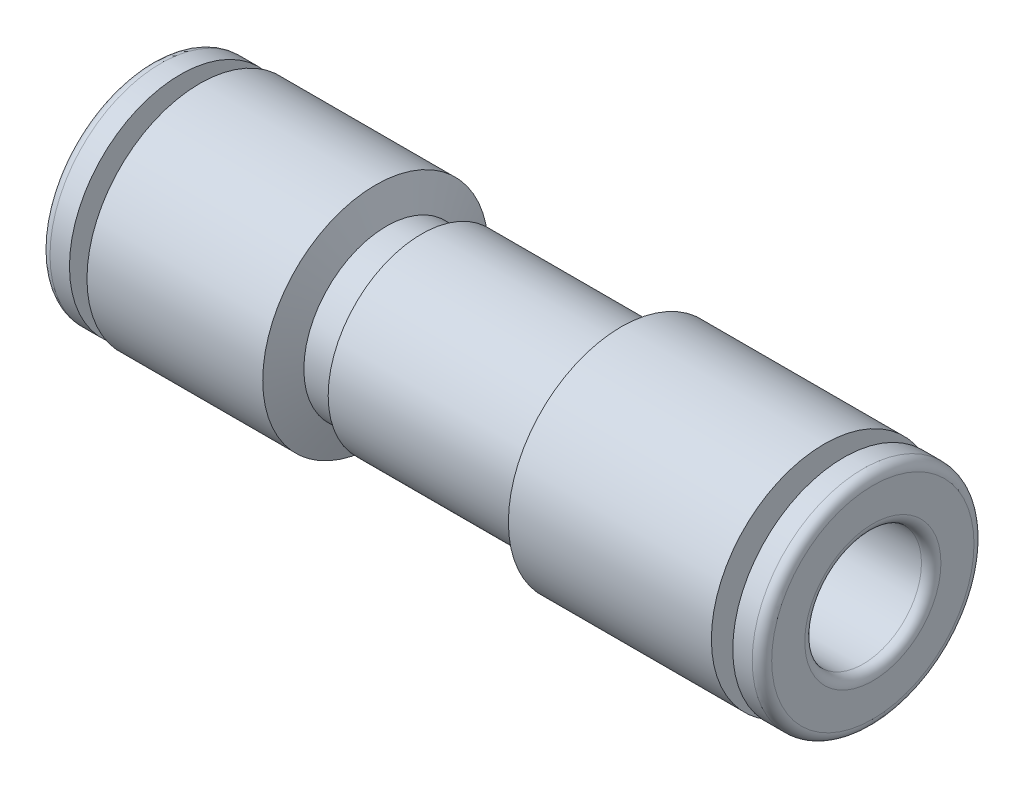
ISO-10303-21;
HEADER;
FILE_DESCRIPTION(('STEP AP214'),'2;1');
FILE_NAME('part.step','',(''),(''),'','','');
FILE_SCHEMA(('AUTOMOTIVE_DESIGN { 1 0 10303 214 1 1 1 1 }'));
ENDSEC;
DATA;
#1=APPLICATION_CONTEXT('core data for automotive mechanical design processes');
#2=APPLICATION_PROTOCOL_DEFINITION('international standard','automotive_design',2000,#1);
#3=PRODUCT_CONTEXT('',#1,'mechanical');
#4=PRODUCT('Part','Part','',(#3));
#5=PRODUCT_RELATED_PRODUCT_CATEGORY('part','',(#4));
#6=PRODUCT_DEFINITION_FORMATION('','',#4);
#7=PRODUCT_DEFINITION_CONTEXT('part definition',#1,'design');
#8=PRODUCT_DEFINITION('design','',#6,#7);
#9=PRODUCT_DEFINITION_SHAPE('','',#8);
#10=(LENGTH_UNIT() NAMED_UNIT(*) SI_UNIT(.MILLI.,.METRE.));
#11=(NAMED_UNIT(*) PLANE_ANGLE_UNIT() SI_UNIT($,.RADIAN.));
#12=(NAMED_UNIT(*) SI_UNIT($,.STERADIAN.) SOLID_ANGLE_UNIT());
#13=UNCERTAINTY_MEASURE_WITH_UNIT(LENGTH_MEASURE(1.E-05),#10,'distance_accuracy_value','');
#14=(GEOMETRIC_REPRESENTATION_CONTEXT(3) GLOBAL_UNCERTAINTY_ASSIGNED_CONTEXT((#13)) GLOBAL_UNIT_ASSIGNED_CONTEXT((#10,
#11,#12)) REPRESENTATION_CONTEXT('',''));
#15=CARTESIAN_POINT('',(0.,0.,0.));
#16=DIRECTION('',(0.,0.,1.));
#17=DIRECTION('',(1.,0.,0.));
#18=AXIS2_PLACEMENT_3D('',#15,#16,#17);
#19=CARTESIAN_POINT('',(0.123549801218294,0.,0.));
#20=DIRECTION('',(1.,0.,0.));
#21=DIRECTION('',(0.,0.,-1.));
#22=AXIS2_PLACEMENT_3D('',#19,#20,#21);
#23=CYLINDRICAL_SURFACE('',#22,4.8);
#24=CARTESIAN_POINT('',(13.9001836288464,0.,0.));
#25=DIRECTION('',(1.,0.,0.));
#26=DIRECTION('',(0.,0.,-1.));
#27=AXIS2_PLACEMENT_3D('',#24,#25,#26);
#28=CIRCLE('',#27,4.8);
#29=CARTESIAN_POINT('',(13.9001836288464,0.,-4.8));
#30=VERTEX_POINT('',#29);
#31=EDGE_CURVE('E50',#30,#30,#28,.T.);
#32=ORIENTED_EDGE('',*,*,#31,.T.);
#33=EDGE_LOOP('',(#32));
#34=FACE_BOUND('',#33,.T.);
#35=CARTESIAN_POINT('',(23.8,0.,0.));
#36=DIRECTION('',(1.,0.,0.));
#37=DIRECTION('',(0.,0.,-1.));
#38=AXIS2_PLACEMENT_3D('',#35,#36,#37);
#39=CIRCLE('',#38,4.8);
#40=CARTESIAN_POINT('',(23.8,0.,-4.79999999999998));
#41=VERTEX_POINT('',#40);
#42=EDGE_CURVE('E57',#41,#41,#39,.F.);
#43=ORIENTED_EDGE('',*,*,#42,.T.);
#44=EDGE_LOOP('',(#43));
#45=FACE_BOUND('',#44,.T.);
#46=ADVANCED_FACE('F33',(#34,#45),#23,.T.);
#47=CARTESIAN_POINT('',(46.6208152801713,0.,0.));
#48=DIRECTION('',(-1.,0.,0.));
#49=DIRECTION('',(0.,0.,1.));
#50=AXIS2_PLACEMENT_3D('',#47,#48,#49);
#51=CYLINDRICAL_SURFACE('',#50,4.25);
#52=CARTESIAN_POINT('',(12.1,0.,0.));
#53=DIRECTION('',(1.,0.,0.));
#54=DIRECTION('',(0.,0.,-1.));
#55=AXIS2_PLACEMENT_3D('',#52,#53,#54);
#56=CIRCLE('',#55,4.25);
#57=CARTESIAN_POINT('',(12.1,0.,-4.25));
#58=VERTEX_POINT('',#57);
#59=EDGE_CURVE('E65',#58,#58,#56,.T.);
#60=ORIENTED_EDGE('',*,*,#59,.T.);
#61=EDGE_LOOP('',(#60));
#62=FACE_BOUND('',#61,.T.);
#63=CARTESIAN_POINT('',(13.7,0.,0.));
#64=DIRECTION('',(1.,0.,0.));
#65=DIRECTION('',(0.,0.,-1.));
#66=AXIS2_PLACEMENT_3D('',#63,#64,#65);
#67=CIRCLE('',#66,4.25);
#68=CARTESIAN_POINT('',(13.7,0.,-4.25));
#69=VERTEX_POINT('',#68);
#70=EDGE_CURVE('E56',#69,#69,#67,.T.);
#71=ORIENTED_EDGE('',*,*,#70,.F.);
#72=EDGE_LOOP('',(#71));
#73=FACE_BOUND('',#72,.T.);
#74=ADVANCED_FACE('F140',(#62,#73),#51,.T.);
#75=CARTESIAN_POINT('',(0.,0.,0.));
#76=DIRECTION('',(-1.,0.,0.));
#77=DIRECTION('',(0.,0.,1.));
#78=AXIS2_PLACEMENT_3D('',#75,#76,#77);
#79=CYLINDRICAL_SURFACE('',#78,3.75);
#80=CARTESIAN_POINT('',(1.5,0.,0.));
#81=DIRECTION('',(-1.,0.,0.));
#82=DIRECTION('',(0.,0.,1.));
#83=AXIS2_PLACEMENT_3D('',#80,#81,#82);
#84=CIRCLE('',#83,3.75);
#85=CARTESIAN_POINT('',(1.5,0.,3.75));
#86=VERTEX_POINT('',#85);
#87=EDGE_CURVE('E64',#86,#86,#84,.T.);
#88=ORIENTED_EDGE('',*,*,#87,.F.);
#89=EDGE_LOOP('',(#88));
#90=FACE_BOUND('',#89,.T.);
#91=CARTESIAN_POINT('',(2.5,0.,0.));
#92=DIRECTION('',(1.,0.,0.));
#93=DIRECTION('',(0.,0.,-1.));
#94=AXIS2_PLACEMENT_3D('',#91,#92,#93);
#95=CIRCLE('',#94,3.75);
#96=CARTESIAN_POINT('',(2.5,0.,-3.75));
#97=VERTEX_POINT('',#96);
#98=EDGE_CURVE('E68',#97,#97,#95,.T.);
#99=ORIENTED_EDGE('',*,*,#98,.F.);
#100=EDGE_LOOP('',(#99));
#101=FACE_BOUND('',#100,.T.);
#102=ADVANCED_FACE('F146',(#90,#101),#79,.T.);
#103=CARTESIAN_POINT('',(1.5,5.7,0.));
#104=DIRECTION('',(-1.,0.,0.));
#105=DIRECTION('',(0.,0.,1.));
#106=AXIS2_PLACEMENT_3D('',#103,#104,#105);
#107=PLANE('',#106);
#108=CARTESIAN_POINT('',(1.5,0.,0.));
#109=DIRECTION('',(-1.,0.,0.));
#110=DIRECTION('',(0.,0.,1.));
#111=AXIS2_PLACEMENT_3D('',#108,#109,#110);
#112=CIRCLE('',#111,5.7);
#113=CARTESIAN_POINT('',(1.5,0.,5.7));
#114=VERTEX_POINT('',#113);
#115=EDGE_CURVE('E71',#114,#114,#112,.T.);
#116=ORIENTED_EDGE('',*,*,#115,.F.);
#117=EDGE_LOOP('',(#116));
#118=FACE_BOUND('',#117,.T.);
#119=ORIENTED_EDGE('',*,*,#87,.T.);
#120=EDGE_LOOP('',(#119));
#121=FACE_BOUND('',#120,.T.);
#122=ADVANCED_FACE('F178',(#118,#121),#107,.F.);
#123=CARTESIAN_POINT('',(0.,0.,0.));
#124=DIRECTION('',(-1.,0.,0.));
#125=DIRECTION('',(0.,0.,1.));
#126=AXIS2_PLACEMENT_3D('',#123,#124,#125);
#127=CYLINDRICAL_SURFACE('',#126,5.7);
#128=CARTESIAN_POINT('',(0.5,0.,0.));
#129=DIRECTION('',(-1.,0.,0.));
#130=DIRECTION('',(0.,0.,1.));
#131=AXIS2_PLACEMENT_3D('',#128,#129,#130);
#132=CIRCLE('',#131,5.7);
#133=CARTESIAN_POINT('',(0.5,0.,5.7));
#134=VERTEX_POINT('',#133);
#135=EDGE_CURVE('E74',#134,#134,#132,.T.);
#136=ORIENTED_EDGE('',*,*,#135,.F.);
#137=EDGE_LOOP('',(#136));
#138=FACE_BOUND('',#137,.T.);
#139=ORIENTED_EDGE('',*,*,#115,.T.);
#140=EDGE_LOOP('',(#139));
#141=FACE_BOUND('',#140,.T.);
#142=ADVANCED_FACE('F174',(#138,#141),#127,.T.);
#143=CARTESIAN_POINT('',(0.5,0.,0.));
#144=DIRECTION('',(-1.,0.,0.));
#145=DIRECTION('',(0.,0.,1.));
#146=AXIS2_PLACEMENT_3D('',#143,#144,#145);
#147=TOROIDAL_SURFACE('',#146,5.2,0.5);
#148=CARTESIAN_POINT('',(0.,0.,0.));
#149=DIRECTION('',(-1.,0.,0.));
#150=DIRECTION('',(0.,0.,1.));
#151=AXIS2_PLACEMENT_3D('',#148,#149,#150);
#152=CIRCLE('',#151,5.2);
#153=CARTESIAN_POINT('',(0.,0.,5.2));
#154=VERTEX_POINT('',#153);
#155=EDGE_CURVE('E77',#154,#154,#152,.T.);
#156=ORIENTED_EDGE('',*,*,#155,.F.);
#157=EDGE_LOOP('',(#156));
#158=FACE_BOUND('',#157,.T.);
#159=ORIENTED_EDGE('',*,*,#135,.T.);
#160=EDGE_LOOP('',(#159));
#161=FACE_BOUND('',#160,.T.);
#162=ADVANCED_FACE('F170',(#158,#161),#147,.T.);
#163=CARTESIAN_POINT('',(0.,0.,0.));
#164=DIRECTION('',(1.,0.,0.));
#165=DIRECTION('',(0.,0.,-1.));
#166=AXIS2_PLACEMENT_3D('',#163,#164,#165);
#167=PLANE('',#166);
#168=CARTESIAN_POINT('',(0.,0.,0.));
#169=DIRECTION('',(1.,0.,0.));
#170=DIRECTION('',(0.,0.,-1.));
#171=AXIS2_PLACEMENT_3D('',#168,#169,#170);
#172=CIRCLE('',#171,3.5);
#173=CARTESIAN_POINT('',(0.,0.,-3.5));
#174=VERTEX_POINT('',#173);
#175=EDGE_CURVE('E41',#174,#174,#172,.T.);
#176=ORIENTED_EDGE('',*,*,#175,.T.);
#177=EDGE_LOOP('',(#176));
#178=FACE_BOUND('',#177,.T.);
#179=ORIENTED_EDGE('',*,*,#155,.T.);
#180=EDGE_LOOP('',(#179));
#181=FACE_BOUND('',#180,.T.);
#182=ADVANCED_FACE('F160',(#178,#181),#167,.F.);
#183=CARTESIAN_POINT('',(2.5,0.,0.));
#184=DIRECTION('',(1.,0.,0.));
#185=DIRECTION('',(0.,0.,-1.));
#186=AXIS2_PLACEMENT_3D('',#183,#184,#185);
#187=PLANE('',#186);
#188=ORIENTED_EDGE('',*,*,#98,.T.);
#189=EDGE_LOOP('',(#188));
#190=FACE_BOUND('',#189,.T.);
#191=CARTESIAN_POINT('',(2.5,0.,0.));
#192=DIRECTION('',(1.,0.,0.));
#193=DIRECTION('',(0.,0.,-1.));
#194=AXIS2_PLACEMENT_3D('',#191,#192,#193);
#195=CIRCLE('',#194,5.8);
#196=CARTESIAN_POINT('',(2.5,0.,5.8));
#197=VERTEX_POINT('',#196);
#198=EDGE_CURVE('E60',#197,#197,#195,.T.);
#199=ORIENTED_EDGE('',*,*,#198,.F.);
#200=EDGE_LOOP('',(#199));
#201=FACE_BOUND('',#200,.T.);
#202=ADVANCED_FACE('F157',(#190,#201),#187,.F.);
#203=CARTESIAN_POINT('',(28.5048773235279,0.,0.));
#204=DIRECTION('',(-1.,0.,0.));
#205=DIRECTION('',(0.,0.,1.));
#206=AXIS2_PLACEMENT_3D('',#203,#204,#205);
#207=CYLINDRICAL_SURFACE('',#206,5.8);
#208=CARTESIAN_POINT('',(11.5358461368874,0.,0.));
#209=DIRECTION('',(1.,0.,0.));
#210=DIRECTION('',(0.,0.,-1.));
#211=AXIS2_PLACEMENT_3D('',#208,#209,#210);
#212=CIRCLE('',#211,5.8);
#213=CARTESIAN_POINT('',(11.5358461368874,0.,5.8));
#214=VERTEX_POINT('',#213);
#215=EDGE_CURVE('E53',#214,#214,#212,.F.);
#216=CARTESIAN_POINT('',(11.5358461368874,0.,5.8));
#217=CARTESIAN_POINT('',(11.4417227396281,0.,5.8));
#218=CARTESIAN_POINT('',(11.3475993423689,0.,5.8));
#219=CARTESIAN_POINT('',(11.1593525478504,0.,5.8));
#220=CARTESIAN_POINT('',(11.0652291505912,0.,5.8));
#221=CARTESIAN_POINT('',(10.8769823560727,0.,5.8));
#222=CARTESIAN_POINT('',(10.7828589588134,0.,5.8));
#223=CARTESIAN_POINT('',(10.594612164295,0.,5.8));
#224=CARTESIAN_POINT('',(10.5004887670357,0.,5.8));
#225=CARTESIAN_POINT('',(10.3122419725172,0.,5.8));
#226=CARTESIAN_POINT('',(10.218118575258,0.,5.8));
#227=CARTESIAN_POINT('',(10.0298717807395,0.,5.8));
#228=CARTESIAN_POINT('',(9.93574838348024,0.,5.8));
#229=CARTESIAN_POINT('',(9.74750158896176,0.,5.8));
#230=CARTESIAN_POINT('',(9.65337819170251,0.,5.8));
#231=CARTESIAN_POINT('',(9.46513139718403,0.,5.8));
#232=CARTESIAN_POINT('',(9.37100799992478,0.,5.8));
#233=CARTESIAN_POINT('',(9.1827612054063,0.,5.8));
#234=CARTESIAN_POINT('',(9.08863780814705,0.,5.8));
#235=CARTESIAN_POINT('',(8.90039101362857,0.,5.8));
#236=CARTESIAN_POINT('',(8.80626761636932,0.,5.8));
#237=CARTESIAN_POINT('',(8.61802082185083,0.,5.8));
#238=CARTESIAN_POINT('',(8.52389742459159,0.,5.8));
#239=CARTESIAN_POINT('',(8.3356506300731,0.,5.8));
#240=CARTESIAN_POINT('',(8.24152723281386,0.,5.8));
#241=CARTESIAN_POINT('',(8.05328043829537,0.,5.8));
#242=CARTESIAN_POINT('',(7.95915704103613,0.,5.8));
#243=CARTESIAN_POINT('',(7.77091024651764,0.,5.8));
#244=CARTESIAN_POINT('',(7.6767868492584,0.,5.8));
#245=CARTESIAN_POINT('',(7.48854005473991,0.,5.8));
#246=CARTESIAN_POINT('',(7.39441665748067,0.,5.8));
#247=CARTESIAN_POINT('',(7.20616986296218,0.,5.8));
#248=CARTESIAN_POINT('',(7.11204646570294,0.,5.8));
#249=CARTESIAN_POINT('',(6.92379967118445,0.,5.8));
#250=CARTESIAN_POINT('',(6.82967627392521,0.,5.8));
#251=CARTESIAN_POINT('',(6.64142947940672,0.,5.8));
#252=CARTESIAN_POINT('',(6.54730608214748,0.,5.8));
#253=CARTESIAN_POINT('',(6.35905928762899,0.,5.8));
#254=CARTESIAN_POINT('',(6.26493589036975,0.,5.8));
#255=CARTESIAN_POINT('',(6.07668909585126,0.,5.8));
#256=CARTESIAN_POINT('',(5.98256569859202,0.,5.8));
#257=CARTESIAN_POINT('',(5.79431890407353,0.,5.8));
#258=CARTESIAN_POINT('',(5.70019550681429,0.,5.8));
#259=CARTESIAN_POINT('',(5.5119487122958,0.,5.8));
#260=CARTESIAN_POINT('',(5.41782531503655,0.,5.8));
#261=CARTESIAN_POINT('',(5.22957852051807,0.,5.8));
#262=CARTESIAN_POINT('',(5.13545512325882,0.,5.8));
#263=CARTESIAN_POINT('',(4.94720832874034,0.,5.8));
#264=CARTESIAN_POINT('',(4.85308493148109,0.,5.8));
#265=CARTESIAN_POINT('',(4.6648381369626,0.,5.8));
#266=CARTESIAN_POINT('',(4.57071473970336,0.,5.8));
#267=CARTESIAN_POINT('',(4.38246794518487,0.,5.8));
#268=CARTESIAN_POINT('',(4.28834454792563,0.,5.8));
#269=CARTESIAN_POINT('',(4.10009775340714,0.,5.8));
#270=CARTESIAN_POINT('',(4.0059743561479,0.,5.8));
#271=CARTESIAN_POINT('',(3.81772756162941,0.,5.8));
#272=CARTESIAN_POINT('',(3.72360416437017,0.,5.8));
#273=CARTESIAN_POINT('',(3.53535736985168,0.,5.8));
#274=CARTESIAN_POINT('',(3.44123397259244,0.,5.8));
#275=CARTESIAN_POINT('',(3.25298717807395,0.,5.8));
#276=CARTESIAN_POINT('',(3.15886378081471,0.,5.8));
#277=CARTESIAN_POINT('',(2.97061698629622,0.,5.8));
#278=CARTESIAN_POINT('',(2.87649358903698,0.,5.8));
#279=CARTESIAN_POINT('',(2.68824679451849,0.,5.8));
#280=CARTESIAN_POINT('',(2.59412339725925,0.,5.8));
#281=CARTESIAN_POINT('',(2.5,0.,5.8));
#282=B_SPLINE_CURVE_WITH_KNOTS('',3,(#216,#217,#218,#219,#220,#221,#222,#223,#224,#225,#226,
#227,#228,#229,#230,#231,#232,#233,#234,#235,#236,#237,#238,#239,#240,#241,#242,#243,#244,#245,
#246,#247,#248,#249,#250,#251,#252,#253,#254,#255,#256,#257,#258,#259,#260,#261,#262,#263,#264,
#265,#266,#267,#268,#269,#270,#271,#272,#273,#274,#275,#276,#277,#278,#279,#280,#281),
.UNSPECIFIED.,.F.,.F.,(4,2,2,2,2,2,2,2,2,2,2,2,2,2,2,2,2,2,2,2,2,2,2,2,2,2,2,2,2,2,2,2,4),(0.,
0.28237019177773,0.564740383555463,0.847110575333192,1.12948076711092,1.41185095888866,
1.69422115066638,1.97659134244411,2.25896153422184,2.54133172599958,2.82370191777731,
3.10607210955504,3.38844230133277,3.6708124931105,3.95318268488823,4.23555287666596,
4.51792306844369,4.80029326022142,5.08266345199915,5.36503364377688,5.64740383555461,
5.92977402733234,6.21214421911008,6.49451441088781,6.77688460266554,7.05925479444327,
7.341624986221,7.62399517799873,7.90636536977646,8.18873556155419,8.47110575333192,
8.75347594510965,9.03584613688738),.UNSPECIFIED.);
#283=EDGE_CURVE('BSEAM154',#214,#197,#282,.T.);
#284=ORIENTED_EDGE('',*,*,#215,.T.);
#285=ORIENTED_EDGE('',*,*,#198,.T.);
#286=ORIENTED_EDGE('',*,*,#283,.T.);
#287=ORIENTED_EDGE('',*,*,#283,.F.);
#288=EDGE_LOOP('',(#284,#286,#285,#287));
#289=FACE_BOUND('',#288,.T.);
#290=ADVANCED_FACE('F154',(#289),#207,.T.);
#291=CARTESIAN_POINT('',(7.3951226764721,0.,0.));
#292=DIRECTION('',(1.,0.,0.));
#293=DIRECTION('',(0.,0.,-1.));
#294=AXIS2_PLACEMENT_3D('',#291,#292,#293);
#295=CYLINDRICAL_SURFACE('',#294,5.8);
#296=CARTESIAN_POINT('',(24.1639702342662,0.,0.));
#297=DIRECTION('',(1.,0.,0.));
#298=DIRECTION('',(0.,0.,-1.));
#299=AXIS2_PLACEMENT_3D('',#296,#297,#298);
#300=CIRCLE('',#299,5.8);
#301=CARTESIAN_POINT('',(24.1639702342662,0.,-5.8));
#302=VERTEX_POINT('',#301);
#303=EDGE_CURVE('E45',#302,#302,#300,.T.);
#304=ORIENTED_EDGE('',*,*,#303,.T.);
#305=EDGE_LOOP('',(#304));
#306=FACE_BOUND('',#305,.T.);
#307=CARTESIAN_POINT('',(34.6,0.,0.));
#308=DIRECTION('',(1.,0.,0.));
#309=DIRECTION('',(0.,0.,-1.));
#310=AXIS2_PLACEMENT_3D('',#307,#308,#309);
#311=CIRCLE('',#310,5.8);
#312=CARTESIAN_POINT('',(34.6,0.,-5.8));
#313=VERTEX_POINT('',#312);
#314=EDGE_CURVE('E61',#313,#313,#311,.T.);
#315=ORIENTED_EDGE('',*,*,#314,.F.);
#316=EDGE_LOOP('',(#315));
#317=FACE_BOUND('',#316,.T.);
#318=ADVANCED_FACE('F152',(#306,#317),#295,.T.);
#319=CARTESIAN_POINT('',(34.6,0.,0.));
#320=DIRECTION('',(1.,0.,0.));
#321=DIRECTION('',(0.,0.,-1.));
#322=AXIS2_PLACEMENT_3D('',#319,#320,#321);
#323=PLANE('',#322);
#324=CARTESIAN_POINT('',(34.6,0.,0.));
#325=DIRECTION('',(-1.,0.,0.));
#326=DIRECTION('',(0.,0.,1.));
#327=AXIS2_PLACEMENT_3D('',#324,#325,#326);
#328=CIRCLE('',#327,3.75);
#329=CARTESIAN_POINT('',(34.6,0.,3.75));
#330=VERTEX_POINT('',#329);
#331=EDGE_CURVE('E98',#330,#330,#328,.T.);
#332=ORIENTED_EDGE('',*,*,#331,.T.);
#333=EDGE_LOOP('',(#332));
#334=FACE_BOUND('',#333,.T.);
#335=ORIENTED_EDGE('',*,*,#314,.T.);
#336=EDGE_LOOP('',(#335));
#337=FACE_BOUND('',#336,.T.);
#338=ADVANCED_FACE('F163',(#334,#337),#323,.T.);
#339=CARTESIAN_POINT('',(37.1,5.2,0.));
#340=DIRECTION('',(-1.,0.,0.));
#341=DIRECTION('',(0.,0.,1.));
#342=AXIS2_PLACEMENT_3D('',#339,#340,#341);
#343=PLANE('',#342);
#344=CARTESIAN_POINT('',(37.1,0.,0.));
#345=DIRECTION('',(1.,0.,0.));
#346=DIRECTION('',(0.,0.,-1.));
#347=AXIS2_PLACEMENT_3D('',#344,#345,#346);
#348=CIRCLE('',#347,3.5);
#349=CARTESIAN_POINT('',(37.1,0.,-3.5));
#350=VERTEX_POINT('',#349);
#351=EDGE_CURVE('E110',#350,#350,#348,.T.);
#352=ORIENTED_EDGE('',*,*,#351,.F.);
#353=EDGE_LOOP('',(#352));
#354=FACE_BOUND('',#353,.T.);
#355=CARTESIAN_POINT('',(37.1,0.,0.));
#356=DIRECTION('',(-1.,0.,0.));
#357=DIRECTION('',(0.,0.,1.));
#358=AXIS2_PLACEMENT_3D('',#355,#356,#357);
#359=CIRCLE('',#358,5.2);
#360=CARTESIAN_POINT('',(37.1,0.,5.2));
#361=VERTEX_POINT('',#360);
#362=EDGE_CURVE('E86',#361,#361,#359,.T.);
#363=ORIENTED_EDGE('',*,*,#362,.F.);
#364=EDGE_LOOP('',(#363));
#365=FACE_BOUND('',#364,.T.);
#366=ADVANCED_FACE('F166',(#354,#365),#343,.F.);
#367=CARTESIAN_POINT('',(36.6,0.,0.));
#368=DIRECTION('',(-1.,0.,0.));
#369=DIRECTION('',(0.,0.,1.));
#370=AXIS2_PLACEMENT_3D('',#367,#368,#369);
#371=TOROIDAL_SURFACE('',#370,5.2,0.5);
#372=CARTESIAN_POINT('',(36.6,0.,0.));
#373=DIRECTION('',(-1.,0.,0.));
#374=DIRECTION('',(0.,0.,1.));
#375=AXIS2_PLACEMENT_3D('',#372,#373,#374);
#376=CIRCLE('',#375,5.7);
#377=CARTESIAN_POINT('',(36.6,0.,5.7));
#378=VERTEX_POINT('',#377);
#379=EDGE_CURVE('E89',#378,#378,#376,.T.);
#380=ORIENTED_EDGE('',*,*,#379,.F.);
#381=EDGE_LOOP('',(#380));
#382=FACE_BOUND('',#381,.T.);
#383=ORIENTED_EDGE('',*,*,#362,.T.);
#384=EDGE_LOOP('',(#383));
#385=FACE_BOUND('',#384,.T.);
#386=ADVANCED_FACE('F228',(#382,#385),#371,.T.);
#387=CARTESIAN_POINT('',(32.43361227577,0.,0.));
#388=DIRECTION('',(-1.,0.,0.));
#389=DIRECTION('',(0.,0.,1.));
#390=AXIS2_PLACEMENT_3D('',#387,#388,#389);
#391=CYLINDRICAL_SURFACE('',#390,5.7);
#392=CARTESIAN_POINT('',(35.6,0.,0.));
#393=DIRECTION('',(-1.,0.,0.));
#394=DIRECTION('',(0.,0.,1.));
#395=AXIS2_PLACEMENT_3D('',#392,#393,#394);
#396=CIRCLE('',#395,5.7);
#397=CARTESIAN_POINT('',(35.6,0.,5.7));
#398=VERTEX_POINT('',#397);
#399=EDGE_CURVE('E92',#398,#398,#396,.T.);
#400=ORIENTED_EDGE('',*,*,#399,.F.);
#401=EDGE_LOOP('',(#400));
#402=FACE_BOUND('',#401,.T.);
#403=ORIENTED_EDGE('',*,*,#379,.T.);
#404=EDGE_LOOP('',(#403));
#405=FACE_BOUND('',#404,.T.);
#406=ADVANCED_FACE('F235',(#402,#405),#391,.T.);
#407=CARTESIAN_POINT('',(35.6,3.75,0.));
#408=DIRECTION('',(1.,0.,0.));
#409=DIRECTION('',(0.,0.,-1.));
#410=AXIS2_PLACEMENT_3D('',#407,#408,#409);
#411=PLANE('',#410);
#412=CARTESIAN_POINT('',(35.6,0.,0.));
#413=DIRECTION('',(-1.,0.,0.));
#414=DIRECTION('',(0.,0.,1.));
#415=AXIS2_PLACEMENT_3D('',#412,#413,#414);
#416=CIRCLE('',#415,3.75);
#417=CARTESIAN_POINT('',(35.6,0.,3.75));
#418=VERTEX_POINT('',#417);
#419=EDGE_CURVE('E95',#418,#418,#416,.T.);
#420=ORIENTED_EDGE('',*,*,#419,.F.);
#421=EDGE_LOOP('',(#420));
#422=FACE_BOUND('',#421,.T.);
#423=ORIENTED_EDGE('',*,*,#399,.T.);
#424=EDGE_LOOP('',(#423));
#425=FACE_BOUND('',#424,.T.);
#426=ADVANCED_FACE('F243',(#422,#425),#411,.F.);
#427=CARTESIAN_POINT('',(32.43361227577,0.,0.));
#428=DIRECTION('',(-1.,0.,0.));
#429=DIRECTION('',(0.,0.,1.));
#430=AXIS2_PLACEMENT_3D('',#427,#428,#429);
#431=CYLINDRICAL_SURFACE('',#430,3.75);
#432=ORIENTED_EDGE('',*,*,#331,.F.);
#433=EDGE_LOOP('',(#432));
#434=FACE_BOUND('',#433,.T.);
#435=ORIENTED_EDGE('',*,*,#419,.T.);
#436=EDGE_LOOP('',(#435));
#437=FACE_BOUND('',#436,.T.);
#438=ADVANCED_FACE('F190',(#434,#437),#431,.T.);
#439=CARTESIAN_POINT('',(12.1,0.,0.));
#440=DIRECTION('',(-1.,0.,0.));
#441=DIRECTION('',(0.,0.,1.));
#442=AXIS2_PLACEMENT_3D('',#439,#440,#441);
#443=CONICAL_SURFACE('',#442,4.24999999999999,1.22173047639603);
#444=ORIENTED_EDGE('',*,*,#215,.F.);
#445=EDGE_LOOP('',(#444));
#446=FACE_BOUND('',#445,.T.);
#447=ORIENTED_EDGE('',*,*,#59,.F.);
#448=EDGE_LOOP('',(#447));
#449=FACE_BOUND('',#448,.T.);
#450=ADVANCED_FACE('F186',(#446,#449),#443,.T.);
#451=CARTESIAN_POINT('',(13.7,0.,0.));
#452=DIRECTION('',(1.,0.,0.));
#453=DIRECTION('',(0.,0.,-1.));
#454=AXIS2_PLACEMENT_3D('',#451,#452,#453);
#455=CONICAL_SURFACE('',#454,4.25,1.22173047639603);
#456=ORIENTED_EDGE('',*,*,#31,.F.);
#457=EDGE_LOOP('',(#456));
#458=FACE_BOUND('',#457,.T.);
#459=ORIENTED_EDGE('',*,*,#70,.T.);
#460=EDGE_LOOP('',(#459));
#461=FACE_BOUND('',#460,.T.);
#462=ADVANCED_FACE('F189',(#458,#461),#455,.T.);
#463=CARTESIAN_POINT('',(23.8,0.,0.));
#464=DIRECTION('',(1.,0.,0.));
#465=DIRECTION('',(0.,0.,-1.));
#466=AXIS2_PLACEMENT_3D('',#463,#464,#465);
#467=CONICAL_SURFACE('',#466,4.79999999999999,1.22173047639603);
#468=CARTESIAN_POINT('',(24.1639702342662,0.,-5.8));
#469=CARTESIAN_POINT('',(24.1601788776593,0.,-5.78958333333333));
#470=CARTESIAN_POINT('',(24.1563875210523,0.,-5.77916666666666));
#471=CARTESIAN_POINT('',(24.1488048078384,0.,-5.75833333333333));
#472=CARTESIAN_POINT('',(24.1450134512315,0.,-5.74791666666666));
#473=CARTESIAN_POINT('',(24.1374307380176,0.,-5.72708333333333));
#474=CARTESIAN_POINT('',(24.1336393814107,0.,-5.71666666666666));
#475=CARTESIAN_POINT('',(24.1260566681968,0.,-5.69583333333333));
#476=CARTESIAN_POINT('',(24.1222653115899,0.,-5.68541666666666));
#477=CARTESIAN_POINT('',(24.114682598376,0.,-5.66458333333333));
#478=CARTESIAN_POINT('',(24.1108912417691,0.,-5.65416666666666));
#479=CARTESIAN_POINT('',(24.1033085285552,0.,-5.63333333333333));
#480=CARTESIAN_POINT('',(24.0995171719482,0.,-5.62291666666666));
#481=CARTESIAN_POINT('',(24.0919344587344,0.,-5.60208333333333));
#482=CARTESIAN_POINT('',(24.0881431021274,0.,-5.59166666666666));
#483=CARTESIAN_POINT('',(24.0805603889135,0.,-5.57083333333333));
#484=CARTESIAN_POINT('',(24.0767690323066,0.,-5.56041666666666));
#485=CARTESIAN_POINT('',(24.0691863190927,0.,-5.53958333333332));
#486=CARTESIAN_POINT('',(24.0653949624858,0.,-5.52916666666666));
#487=CARTESIAN_POINT('',(24.0578122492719,0.,-5.50833333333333));
#488=CARTESIAN_POINT('',(24.054020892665,0.,-5.49791666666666));
#489=CARTESIAN_POINT('',(24.0464381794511,0.,-5.47708333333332));
#490=CARTESIAN_POINT('',(24.0426468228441,0.,-5.46666666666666));
#491=CARTESIAN_POINT('',(24.0350641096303,0.,-5.44583333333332));
#492=CARTESIAN_POINT('',(24.0312727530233,0.,-5.43541666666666));
#493=CARTESIAN_POINT('',(24.0236900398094,0.,-5.41458333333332));
#494=CARTESIAN_POINT('',(24.0198986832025,0.,-5.40416666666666));
#495=CARTESIAN_POINT('',(24.0123159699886,0.,-5.38333333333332));
#496=CARTESIAN_POINT('',(24.0085246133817,0.,-5.37291666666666));
#497=CARTESIAN_POINT('',(24.0009419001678,0.,-5.35208333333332));
#498=CARTESIAN_POINT('',(23.9971505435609,0.,-5.34166666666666));
#499=CARTESIAN_POINT('',(23.989567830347,0.,-5.32083333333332));
#500=CARTESIAN_POINT('',(23.98577647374,0.,-5.31041666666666));
#501=CARTESIAN_POINT('',(23.9781937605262,0.,-5.28958333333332));
#502=CARTESIAN_POINT('',(23.9744024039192,0.,-5.27916666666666));
#503=CARTESIAN_POINT('',(23.9668196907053,0.,-5.25833333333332));
#504=CARTESIAN_POINT('',(23.9630283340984,0.,-5.24791666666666));
#505=CARTESIAN_POINT('',(23.9554456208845,0.,-5.22708333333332));
#506=CARTESIAN_POINT('',(23.9516542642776,0.,-5.21666666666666));
#507=CARTESIAN_POINT('',(23.9440715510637,0.,-5.19583333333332));
#508=CARTESIAN_POINT('',(23.9402801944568,0.,-5.18541666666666));
#509=CARTESIAN_POINT('',(23.9326974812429,0.,-5.16458333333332));
#510=CARTESIAN_POINT('',(23.9289061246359,0.,-5.15416666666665));
#511=CARTESIAN_POINT('',(23.9213234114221,0.,-5.13333333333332));
#512=CARTESIAN_POINT('',(23.9175320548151,0.,-5.12291666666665));
#513=CARTESIAN_POINT('',(23.9099493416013,0.,-5.10208333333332));
#514=CARTESIAN_POINT('',(23.9061579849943,0.,-5.09166666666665));
#515=CARTESIAN_POINT('',(23.8985752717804,0.,-5.07083333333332));
#516=CARTESIAN_POINT('',(23.8947839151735,0.,-5.06041666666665));
#517=CARTESIAN_POINT('',(23.8872012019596,0.,-5.03958333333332));
#518=CARTESIAN_POINT('',(23.8834098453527,0.,-5.02916666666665));
#519=CARTESIAN_POINT('',(23.8758271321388,0.,-5.00833333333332));
#520=CARTESIAN_POINT('',(23.8720357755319,0.,-4.99791666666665));
#521=CARTESIAN_POINT('',(23.864453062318,0.,-4.97708333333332));
#522=CARTESIAN_POINT('',(23.860661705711,0.,-4.96666666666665));
#523=CARTESIAN_POINT('',(23.8530789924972,0.,-4.94583333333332));
#524=CARTESIAN_POINT('',(23.8492876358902,0.,-4.93541666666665));
#525=CARTESIAN_POINT('',(23.8417049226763,0.,-4.91458333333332));
#526=CARTESIAN_POINT('',(23.8379135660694,0.,-4.90416666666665));
#527=CARTESIAN_POINT('',(23.8303308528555,0.,-4.88333333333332));
#528=CARTESIAN_POINT('',(23.8265394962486,0.,-4.87291666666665));
#529=CARTESIAN_POINT('',(23.8189567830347,0.,-4.85208333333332));
#530=CARTESIAN_POINT('',(23.8151654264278,0.,-4.84166666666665));
#531=CARTESIAN_POINT('',(23.8075827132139,0.,-4.82083333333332));
#532=CARTESIAN_POINT('',(23.8037913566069,0.,-4.81041666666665));
#533=CARTESIAN_POINT('',(23.8,0.,-4.79999999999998));
#534=B_SPLINE_CURVE_WITH_KNOTS('',3,(#468,#469,#470,#471,#472,#473,#474,#475,#476,#477,#478,
#479,#480,#481,#482,#483,#484,#485,#486,#487,#488,#489,#490,#491,#492,#493,#494,#495,#496,#497,
#498,#499,#500,#501,#502,#503,#504,#505,#506,#507,#508,#509,#510,#511,#512,#513,#514,#515,#516,
#517,#518,#519,#520,#521,#522,#523,#524,#525,#526,#527,#528,#529,#530,#531,#532,#533),
.UNSPECIFIED.,.F.,.F.,(4,2,2,2,2,2,2,2,2,2,2,2,2,2,2,2,2,2,2,2,2,2,2,2,2,2,2,2,2,2,2,2,4),(0.,
0.0332555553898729,0.0665111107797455,0.0997666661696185,0.13302222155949,0.166277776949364,
0.199533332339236,0.232788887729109,0.266044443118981,0.299299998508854,0.332555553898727,
0.3658111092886,0.399066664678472,0.432322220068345,0.465577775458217,0.498833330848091,
0.532088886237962,0.565344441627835,0.598599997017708,0.63185555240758,0.665111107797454,
0.698366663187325,0.731622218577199,0.764877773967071,0.798133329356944,0.831388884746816,
0.864644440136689,0.897899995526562,0.931155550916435,0.964411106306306,0.99766666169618,
1.03092221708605,1.06417777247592),.UNSPECIFIED.);
#535=EDGE_CURVE('BSEAM193',#302,#41,#534,.T.);
#536=ORIENTED_EDGE('',*,*,#303,.F.);
#537=ORIENTED_EDGE('',*,*,#42,.F.);
#538=ORIENTED_EDGE('',*,*,#535,.T.);
#539=ORIENTED_EDGE('',*,*,#535,.F.);
#540=EDGE_LOOP('',(#536,#538,#537,#539));
#541=FACE_BOUND('',#540,.T.);
#542=ADVANCED_FACE('F193',(#541),#467,.T.);
#543=CARTESIAN_POINT('',(13.5,0.,0.));
#544=DIRECTION('',(-1.,0.,0.));
#545=DIRECTION('',(0.,0.,1.));
#546=AXIS2_PLACEMENT_3D('',#543,#544,#545);
#547=CYLINDRICAL_SURFACE('',#546,3.);
#548=CARTESIAN_POINT('',(0.5,0.,0.));
#549=DIRECTION('',(1.,0.,0.));
#550=DIRECTION('',(0.,0.,-1.));
#551=AXIS2_PLACEMENT_3D('',#548,#549,#550);
#552=CIRCLE('',#551,3.);
#553=CARTESIAN_POINT('',(0.5,0.,-3.));
#554=VERTEX_POINT('',#553);
#555=EDGE_CURVE('E10',#554,#554,#552,.F.);
#556=ORIENTED_EDGE('',*,*,#555,.T.);
#557=EDGE_LOOP('',(#556));
#558=FACE_BOUND('',#557,.T.);
#559=CARTESIAN_POINT('',(13.5,0.,0.));
#560=DIRECTION('',(1.,0.,0.));
#561=DIRECTION('',(0.,0.,-1.));
#562=AXIS2_PLACEMENT_3D('',#559,#560,#561);
#563=CIRCLE('',#562,3.);
#564=CARTESIAN_POINT('',(13.5,0.,-3.));
#565=VERTEX_POINT('',#564);
#566=EDGE_CURVE('E101',#565,#565,#563,.T.);
#567=ORIENTED_EDGE('',*,*,#566,.T.);
#568=EDGE_LOOP('',(#567));
#569=FACE_BOUND('',#568,.T.);
#570=ADVANCED_FACE('F196',(#558,#569),#547,.F.);
#571=CARTESIAN_POINT('',(13.5,0.,0.));
#572=DIRECTION('',(1.,0.,0.));
#573=DIRECTION('',(0.,0.,-1.));
#574=AXIS2_PLACEMENT_3D('',#571,#572,#573);
#575=PLANE('',#574);
#576=CARTESIAN_POINT('',(13.5,0.,0.));
#577=DIRECTION('',(1.,0.,0.));
#578=DIRECTION('',(0.,0.,-1.));
#579=AXIS2_PLACEMENT_3D('',#576,#577,#578);
#580=CIRCLE('',#579,2.25);
#581=CARTESIAN_POINT('',(13.5,0.,-2.25));
#582=VERTEX_POINT('',#581);
#583=EDGE_CURVE('E113',#582,#582,#580,.F.);
#584=ORIENTED_EDGE('',*,*,#583,.F.);
#585=EDGE_LOOP('',(#584));
#586=FACE_BOUND('',#585,.T.);
#587=ORIENTED_EDGE('',*,*,#566,.F.);
#588=EDGE_LOOP('',(#587));
#589=FACE_BOUND('',#588,.T.);
#590=ADVANCED_FACE('F201',(#586,#589),#575,.F.);
#591=CARTESIAN_POINT('',(0.5,0.,0.));
#592=DIRECTION('',(1.,0.,0.));
#593=DIRECTION('',(0.,0.,-1.));
#594=AXIS2_PLACEMENT_3D('',#591,#592,#593);
#595=TOROIDAL_SURFACE('',#594,3.5,0.5);
#596=ORIENTED_EDGE('',*,*,#555,.F.);
#597=EDGE_LOOP('',(#596));
#598=FACE_BOUND('',#597,.T.);
#599=ORIENTED_EDGE('',*,*,#175,.F.);
#600=EDGE_LOOP('',(#599));
#601=FACE_BOUND('',#600,.T.);
#602=ADVANCED_FACE('F35',(#598,#601),#595,.T.);
#603=CARTESIAN_POINT('',(23.6,0.,0.));
#604=DIRECTION('',(-1.,0.,0.));
#605=DIRECTION('',(0.,0.,-1.));
#606=AXIS2_PLACEMENT_3D('',#603,#604,#605);
#607=PLANE('',#606);
#608=CARTESIAN_POINT('',(23.6,0.,0.));
#609=DIRECTION('',(-1.,0.,0.));
#610=DIRECTION('',(0.,0.,1.));
#611=AXIS2_PLACEMENT_3D('',#608,#609,#610);
#612=CIRCLE('',#611,2.25);
#613=CARTESIAN_POINT('',(23.6,0.,2.25));
#614=VERTEX_POINT('',#613);
#615=EDGE_CURVE('E37',#614,#614,#612,.F.);
#616=ORIENTED_EDGE('',*,*,#615,.F.);
#617=EDGE_LOOP('',(#616));
#618=FACE_BOUND('',#617,.T.);
#619=CARTESIAN_POINT('',(23.6,0.,0.));
#620=DIRECTION('',(1.,0.,0.));
#621=DIRECTION('',(0.,0.,-1.));
#622=AXIS2_PLACEMENT_3D('',#619,#620,#621);
#623=CIRCLE('',#622,3.);
#624=CARTESIAN_POINT('',(23.6,0.,-3.));
#625=VERTEX_POINT('',#624);
#626=EDGE_CURVE('E104',#625,#625,#623,.T.);
#627=ORIENTED_EDGE('',*,*,#626,.T.);
#628=EDGE_LOOP('',(#627));
#629=FACE_BOUND('',#628,.T.);
#630=ADVANCED_FACE('F122',(#618,#629),#607,.F.);
#631=CARTESIAN_POINT('',(23.6,0.,0.));
#632=DIRECTION('',(1.,0.,0.));
#633=DIRECTION('',(0.,0.,1.));
#634=AXIS2_PLACEMENT_3D('',#631,#632,#633);
#635=CYLINDRICAL_SURFACE('',#634,3.);
#636=CARTESIAN_POINT('',(36.6,0.,0.));
#637=DIRECTION('',(1.,0.,0.));
#638=DIRECTION('',(0.,0.,-1.));
#639=AXIS2_PLACEMENT_3D('',#636,#637,#638);
#640=CIRCLE('',#639,3.);
#641=CARTESIAN_POINT('',(36.6,0.,-3.));
#642=VERTEX_POINT('',#641);
#643=EDGE_CURVE('E107',#642,#642,#640,.F.);
#644=ORIENTED_EDGE('',*,*,#643,.F.);
#645=EDGE_LOOP('',(#644));
#646=FACE_BOUND('',#645,.T.);
#647=ORIENTED_EDGE('',*,*,#626,.F.);
#648=EDGE_LOOP('',(#647));
#649=FACE_BOUND('',#648,.T.);
#650=ADVANCED_FACE('F125',(#646,#649),#635,.F.);
#651=CARTESIAN_POINT('',(36.6,0.,0.));
#652=DIRECTION('',(-1.,0.,0.));
#653=DIRECTION('',(0.,0.,-1.));
#654=AXIS2_PLACEMENT_3D('',#651,#652,#653);
#655=TOROIDAL_SURFACE('',#654,3.5,0.5);
#656=ORIENTED_EDGE('',*,*,#643,.T.);
#657=EDGE_LOOP('',(#656));
#658=FACE_BOUND('',#657,.T.);
#659=ORIENTED_EDGE('',*,*,#351,.T.);
#660=EDGE_LOOP('',(#659));
#661=FACE_BOUND('',#660,.T.);
#662=ADVANCED_FACE('F130',(#658,#661),#655,.T.);
#663=CARTESIAN_POINT('',(37.1,0.,0.));
#664=DIRECTION('',(-1.,0.,0.));
#665=DIRECTION('',(0.,0.,1.));
#666=AXIS2_PLACEMENT_3D('',#663,#664,#665);
#667=CYLINDRICAL_SURFACE('',#666,2.25);
#668=ORIENTED_EDGE('',*,*,#615,.T.);
#669=EDGE_LOOP('',(#668));
#670=FACE_BOUND('',#669,.T.);
#671=ORIENTED_EDGE('',*,*,#583,.T.);
#672=EDGE_LOOP('',(#671));
#673=FACE_BOUND('',#672,.T.);
#674=ADVANCED_FACE('F120',(#670,#673),#667,.F.);
#675=CLOSED_SHELL('',(#46,#74,#102,#122,#142,#162,#182,#202,#290,#318,#338,#366,#386,#406,#426,
#438,#450,#462,#542,#570,#590,#602,#630,#650,#662,#674));
#676=MANIFOLD_SOLID_BREP('B2',#675);
#677=ADVANCED_BREP_SHAPE_REPRESENTATION('',(#18,#676),#14);
#678=SHAPE_DEFINITION_REPRESENTATION(#9,#677);
ENDSEC;
END-ISO-10303-21;
